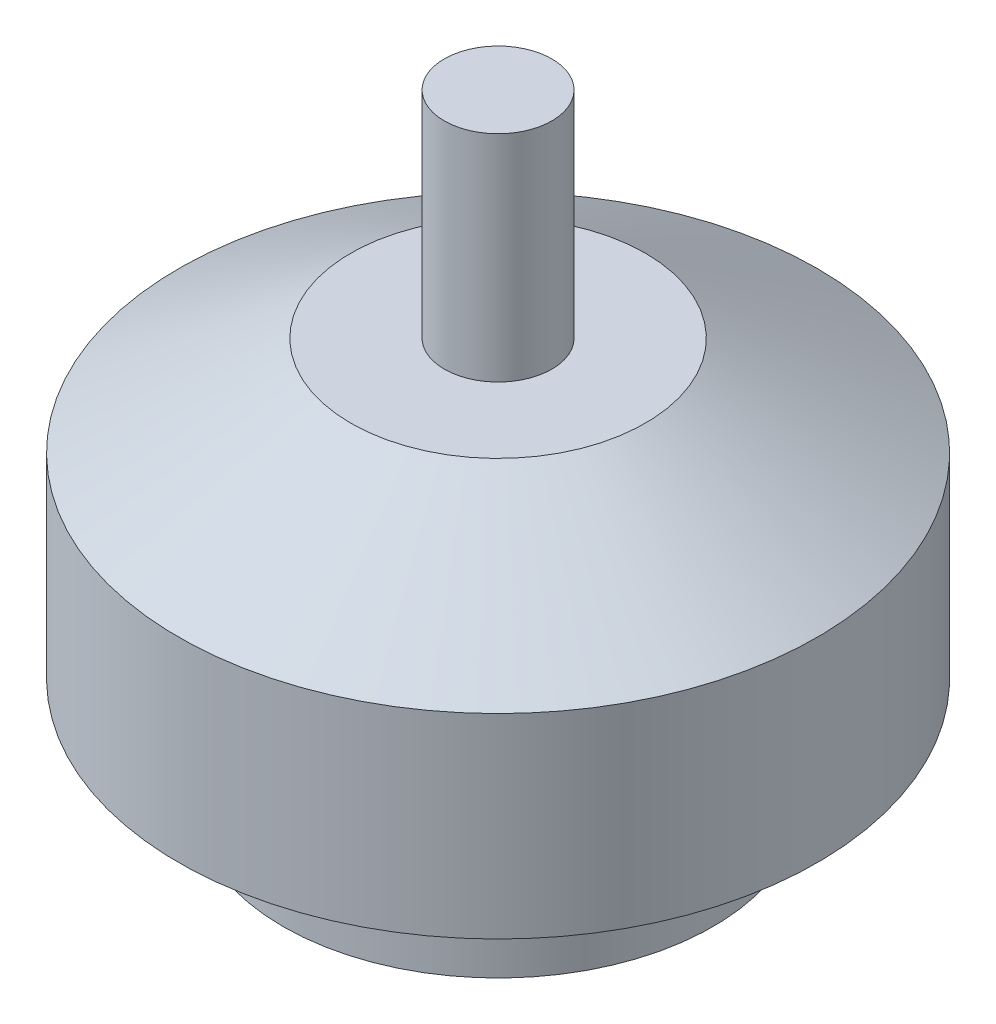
ISO-10303-21;
HEADER;
FILE_DESCRIPTION(('STEP AP214'),'2;1');
FILE_NAME('part.step','',(''),(''),'','','');
FILE_SCHEMA(('AUTOMOTIVE_DESIGN { 1 0 10303 214 1 1 1 1 }'));
ENDSEC;
DATA;
#1=APPLICATION_CONTEXT('core data for automotive mechanical design processes');
#2=APPLICATION_PROTOCOL_DEFINITION('international standard','automotive_design',2000,#1);
#3=PRODUCT_CONTEXT('',#1,'mechanical');
#4=PRODUCT('Part','Part','',(#3));
#5=PRODUCT_RELATED_PRODUCT_CATEGORY('part','',(#4));
#6=PRODUCT_DEFINITION_FORMATION('','',#4);
#7=PRODUCT_DEFINITION_CONTEXT('part definition',#1,'design');
#8=PRODUCT_DEFINITION('design','',#6,#7);
#9=PRODUCT_DEFINITION_SHAPE('','',#8);
#10=(LENGTH_UNIT() NAMED_UNIT(*) SI_UNIT(.MILLI.,.METRE.));
#11=(NAMED_UNIT(*) PLANE_ANGLE_UNIT() SI_UNIT($,.RADIAN.));
#12=(NAMED_UNIT(*) SI_UNIT($,.STERADIAN.) SOLID_ANGLE_UNIT());
#13=UNCERTAINTY_MEASURE_WITH_UNIT(LENGTH_MEASURE(1.E-05),#10,'distance_accuracy_value','');
#14=(GEOMETRIC_REPRESENTATION_CONTEXT(3) GLOBAL_UNCERTAINTY_ASSIGNED_CONTEXT((#13)) GLOBAL_UNIT_ASSIGNED_CONTEXT((#10,
#11,#12)) REPRESENTATION_CONTEXT('',''));
#15=CARTESIAN_POINT('',(0.,0.,0.));
#16=DIRECTION('',(0.,0.,1.));
#17=DIRECTION('',(1.,0.,0.));
#18=AXIS2_PLACEMENT_3D('',#15,#16,#17);
#19=CARTESIAN_POINT('',(0.,5.,0.));
#20=DIRECTION('',(0.,-1.,0.));
#21=DIRECTION('',(0.,0.,-1.));
#22=AXIS2_PLACEMENT_3D('',#19,#20,#21);
#23=CYLINDRICAL_SURFACE('',#22,10.);
#24=CARTESIAN_POINT('',(0.,5.,0.));
#25=DIRECTION('',(0.,1.,0.));
#26=DIRECTION('',(0.,0.,1.));
#27=AXIS2_PLACEMENT_3D('',#24,#25,#26);
#28=CIRCLE('',#27,10.);
#29=CARTESIAN_POINT('',(0.,5.,10.));
#30=VERTEX_POINT('',#29);
#31=EDGE_CURVE('E54',#30,#30,#28,.T.);
#32=ORIENTED_EDGE('',*,*,#31,.F.);
#33=EDGE_LOOP('',(#32));
#34=FACE_BOUND('',#33,.T.);
#35=CARTESIAN_POINT('',(0.,0.,0.));
#36=DIRECTION('',(0.,1.,0.));
#37=DIRECTION('',(0.,0.,1.));
#38=AXIS2_PLACEMENT_3D('',#35,#36,#37);
#39=CIRCLE('',#38,10.);
#40=CARTESIAN_POINT('',(0.,0.,10.));
#41=VERTEX_POINT('',#40);
#42=EDGE_CURVE('E53',#41,#41,#39,.T.);
#43=ORIENTED_EDGE('',*,*,#42,.T.);
#44=EDGE_LOOP('',(#43));
#45=FACE_BOUND('',#44,.T.);
#46=ADVANCED_FACE('F34',(#34,#45),#23,.T.);
#47=CARTESIAN_POINT('',(0.,0.,0.));
#48=DIRECTION('',(0.,1.,0.));
#49=DIRECTION('',(0.,0.,1.));
#50=AXIS2_PLACEMENT_3D('',#47,#48,#49);
#51=PLANE('',#50);
#52=ORIENTED_EDGE('',*,*,#42,.F.);
#53=EDGE_LOOP('',(#52));
#54=FACE_BOUND('',#53,.T.);
#55=ADVANCED_FACE('F78',(#54),#51,.F.);
#56=CARTESIAN_POINT('',(0.,18.7,0.));
#57=DIRECTION('',(0.,-1.,0.));
#58=DIRECTION('',(0.,0.,-1.));
#59=AXIS2_PLACEMENT_3D('',#56,#57,#58);
#60=CYLINDRICAL_SURFACE('',#59,14.85);
#61=CARTESIAN_POINT('',(0.,14.081197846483,0.));
#62=DIRECTION('',(0.,1.,0.));
#63=DIRECTION('',(0.,0.,1.));
#64=AXIS2_PLACEMENT_3D('',#61,#62,#63);
#65=CIRCLE('',#64,14.85);
#66=CARTESIAN_POINT('',(0.,14.081197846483,-14.85));
#67=VERTEX_POINT('',#66);
#68=EDGE_CURVE('E38',#67,#67,#65,.F.);
#69=CARTESIAN_POINT('',(0.,5.,0.));
#70=DIRECTION('',(0.,1.,0.));
#71=DIRECTION('',(0.,0.,1.));
#72=AXIS2_PLACEMENT_3D('',#69,#70,#71);
#73=CIRCLE('',#72,14.85);
#74=CARTESIAN_POINT('',(0.,5.,-14.85));
#75=VERTEX_POINT('',#74);
#76=EDGE_CURVE('E50',#75,#75,#73,.T.);
#77=CARTESIAN_POINT('',(0.,14.081197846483,-14.85));
#78=CARTESIAN_POINT('',(0.,13.9866020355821,-14.85));
#79=CARTESIAN_POINT('',(0.,13.8920062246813,-14.85));
#80=CARTESIAN_POINT('',(0.,13.7028146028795,-14.85));
#81=CARTESIAN_POINT('',(0.,13.6082187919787,-14.85));
#82=CARTESIAN_POINT('',(0.,13.4190271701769,-14.85));
#83=CARTESIAN_POINT('',(0.,13.3244313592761,-14.85));
#84=CARTESIAN_POINT('',(0.,13.1352397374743,-14.85));
#85=CARTESIAN_POINT('',(0.,13.0406439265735,-14.85));
#86=CARTESIAN_POINT('',(0.,12.8514523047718,-14.85));
#87=CARTESIAN_POINT('',(0.,12.7568564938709,-14.85));
#88=CARTESIAN_POINT('',(0.,12.5676648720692,-14.85));
#89=CARTESIAN_POINT('',(0.,12.4730690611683,-14.85));
#90=CARTESIAN_POINT('',(0.,12.2838774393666,-14.85));
#91=CARTESIAN_POINT('',(0.,12.1892816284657,-14.85));
#92=CARTESIAN_POINT('',(0.,12.000090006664,-14.85));
#93=CARTESIAN_POINT('',(0.,11.9054941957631,-14.85));
#94=CARTESIAN_POINT('',(0.,11.7163025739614,-14.85));
#95=CARTESIAN_POINT('',(0.,11.6217067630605,-14.85));
#96=CARTESIAN_POINT('',(0.,11.4325151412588,-14.85));
#97=CARTESIAN_POINT('',(0.,11.3379193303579,-14.85));
#98=CARTESIAN_POINT('',(0.,11.1487277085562,-14.85));
#99=CARTESIAN_POINT('',(0.,11.0541318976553,-14.85));
#100=CARTESIAN_POINT('',(0.,10.8649402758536,-14.85));
#101=CARTESIAN_POINT('',(0.,10.7703444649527,-14.85));
#102=CARTESIAN_POINT('',(0.,10.581152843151,-14.85));
#103=CARTESIAN_POINT('',(0.,10.4865570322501,-14.85));
#104=CARTESIAN_POINT('',(0.,10.2973654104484,-14.85));
#105=CARTESIAN_POINT('',(0.,10.2027695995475,-14.85));
#106=CARTESIAN_POINT('',(0.,10.0135779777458,-14.85));
#107=CARTESIAN_POINT('',(0.,9.91898216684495,-14.85));
#108=CARTESIAN_POINT('',(0.,9.72979054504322,-14.85));
#109=CARTESIAN_POINT('',(0.,9.63519473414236,-14.85));
#110=CARTESIAN_POINT('',(0.,9.44600311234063,-14.85));
#111=CARTESIAN_POINT('',(0.,9.35140730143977,-14.85));
#112=CARTESIAN_POINT('',(0.,9.16221567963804,-14.85));
#113=CARTESIAN_POINT('',(0.,9.06761986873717,-14.85));
#114=CARTESIAN_POINT('',(0.,8.87842824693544,-14.85));
#115=CARTESIAN_POINT('',(0.,8.78383243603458,-14.85));
#116=CARTESIAN_POINT('',(0.,8.59464081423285,-14.85));
#117=CARTESIAN_POINT('',(0.,8.50004500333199,-14.85));
#118=CARTESIAN_POINT('',(0.,8.31085338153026,-14.85));
#119=CARTESIAN_POINT('',(0.,8.21625757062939,-14.85));
#120=CARTESIAN_POINT('',(0.,8.02706594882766,-14.85));
#121=CARTESIAN_POINT('',(0.,7.9324701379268,-14.85));
#122=CARTESIAN_POINT('',(0.,7.74327851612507,-14.85));
#123=CARTESIAN_POINT('',(0.,7.64868270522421,-14.85));
#124=CARTESIAN_POINT('',(0.,7.45949108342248,-14.85));
#125=CARTESIAN_POINT('',(0.,7.36489527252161,-14.85));
#126=CARTESIAN_POINT('',(0.,7.17570365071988,-14.85));
#127=CARTESIAN_POINT('',(0.,7.08110783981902,-14.85));
#128=CARTESIAN_POINT('',(0.,6.89191621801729,-14.85));
#129=CARTESIAN_POINT('',(0.,6.79732040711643,-14.85));
#130=CARTESIAN_POINT('',(0.,6.6081287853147,-14.85));
#131=CARTESIAN_POINT('',(0.,6.51353297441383,-14.85));
#132=CARTESIAN_POINT('',(0.,6.3243413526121,-14.85));
#133=CARTESIAN_POINT('',(0.,6.22974554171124,-14.85));
#134=CARTESIAN_POINT('',(0.,6.04055391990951,-14.85));
#135=CARTESIAN_POINT('',(0.,5.94595810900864,-14.85));
#136=CARTESIAN_POINT('',(0.,5.75676648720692,-14.85));
#137=CARTESIAN_POINT('',(0.,5.66217067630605,-14.85));
#138=CARTESIAN_POINT('',(0.,5.47297905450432,-14.85));
#139=CARTESIAN_POINT('',(0.,5.37838324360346,-14.85));
#140=CARTESIAN_POINT('',(0.,5.18919162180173,-14.85));
#141=CARTESIAN_POINT('',(0.,5.09459581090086,-14.85));
#142=CARTESIAN_POINT('',(0.,5.,-14.85));
#143=B_SPLINE_CURVE_WITH_KNOTS('',3,(#77,#78,#79,#80,#81,#82,#83,#84,#85,#86,#87,#88,#89,#90,
#91,#92,#93,#94,#95,#96,#97,#98,#99,#100,#101,#102,#103,#104,#105,#106,#107,#108,#109,#110,#111,
#112,#113,#114,#115,#116,#117,#118,#119,#120,#121,#122,#123,#124,#125,#126,#127,#128,#129,#130,
#131,#132,#133,#134,#135,#136,#137,#138,#139,#140,#141,#142),.UNSPECIFIED.,.F.,.F.,(4,2,2,2,2,2,
2,2,2,2,2,2,2,2,2,2,2,2,2,2,2,2,2,2,2,2,2,2,2,2,2,2,4),(0.,0.283787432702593,0.567574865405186,
0.851362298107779,1.13514973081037,1.41893716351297,1.70272459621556,1.98651202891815,
2.27029946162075,2.55408689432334,2.83787432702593,3.12166175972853,3.40544919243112,
3.68923662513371,3.97302405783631,4.2568114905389,4.54059892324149,4.82438635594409,
5.10817378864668,5.39196122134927,5.67574865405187,5.95953608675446,6.24332351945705,
6.52711095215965,6.81089838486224,7.09468581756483,7.37847325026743,7.66226068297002,
7.94604811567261,8.22983554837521,8.5136229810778,8.7974104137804,9.08119784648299),.UNSPECIFIED.);
#144=EDGE_CURVE('BSEAM83',#67,#75,#143,.T.);
#145=ORIENTED_EDGE('',*,*,#68,.T.);
#146=ORIENTED_EDGE('',*,*,#76,.T.);
#147=ORIENTED_EDGE('',*,*,#144,.T.);
#148=ORIENTED_EDGE('',*,*,#144,.F.);
#149=EDGE_LOOP('',(#145,#147,#146,#148));
#150=FACE_BOUND('',#149,.T.);
#151=ADVANCED_FACE('F83',(#150),#60,.T.);
#152=CARTESIAN_POINT('',(0.,18.7,0.));
#153=DIRECTION('',(0.,1.,0.));
#154=DIRECTION('',(0.,0.,1.));
#155=AXIS2_PLACEMENT_3D('',#152,#153,#154);
#156=PLANE('',#155);
#157=CARTESIAN_POINT('',(0.,18.7,0.));
#158=DIRECTION('',(0.,1.,0.));
#159=DIRECTION('',(0.,0.,1.));
#160=AXIS2_PLACEMENT_3D('',#157,#158,#159);
#161=CIRCLE('',#160,2.5);
#162=CARTESIAN_POINT('',(0.,18.7,2.5));
#163=VERTEX_POINT('',#162);
#164=EDGE_CURVE('E10',#163,#163,#161,.T.);
#165=ORIENTED_EDGE('',*,*,#164,.F.);
#166=EDGE_LOOP('',(#165));
#167=FACE_BOUND('',#166,.T.);
#168=CARTESIAN_POINT('',(0.,18.7,0.));
#169=DIRECTION('',(0.,1.,0.));
#170=DIRECTION('',(0.,0.,1.));
#171=AXIS2_PLACEMENT_3D('',#168,#169,#170);
#172=CIRCLE('',#171,6.84999999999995);
#173=CARTESIAN_POINT('',(0.,18.7,6.84999999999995));
#174=VERTEX_POINT('',#173);
#175=EDGE_CURVE('E46',#174,#174,#172,.T.);
#176=ORIENTED_EDGE('',*,*,#175,.T.);
#177=EDGE_LOOP('',(#176));
#178=FACE_BOUND('',#177,.T.);
#179=ADVANCED_FACE('F61',(#167,#178),#156,.T.);
#180=CARTESIAN_POINT('',(0.,5.,0.));
#181=DIRECTION('',(0.,1.,0.));
#182=DIRECTION('',(0.,0.,1.));
#183=AXIS2_PLACEMENT_3D('',#180,#181,#182);
#184=PLANE('',#183);
#185=ORIENTED_EDGE('',*,*,#31,.T.);
#186=EDGE_LOOP('',(#185));
#187=FACE_BOUND('',#186,.T.);
#188=ORIENTED_EDGE('',*,*,#76,.F.);
#189=EDGE_LOOP('',(#188));
#190=FACE_BOUND('',#189,.T.);
#191=ADVANCED_FACE('F65',(#187,#190),#184,.F.);
#192=CARTESIAN_POINT('',(0.,18.7,0.));
#193=DIRECTION('',(0.,-1.,0.));
#194=DIRECTION('',(0.,0.,-1.));
#195=AXIS2_PLACEMENT_3D('',#192,#193,#194);
#196=CONICAL_SURFACE('',#195,6.84999999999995,1.0471975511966);
#197=ORIENTED_EDGE('',*,*,#68,.F.);
#198=EDGE_LOOP('',(#197));
#199=FACE_BOUND('',#198,.T.);
#200=ORIENTED_EDGE('',*,*,#175,.F.);
#201=EDGE_LOOP('',(#200));
#202=FACE_BOUND('',#201,.T.);
#203=ADVANCED_FACE('F36',(#199,#202),#196,.T.);
#204=CARTESIAN_POINT('',(0.,28.7,0.));
#205=DIRECTION('',(0.,-1.,0.));
#206=DIRECTION('',(0.,0.,-1.));
#207=AXIS2_PLACEMENT_3D('',#204,#205,#206);
#208=CYLINDRICAL_SURFACE('',#207,2.5);
#209=CARTESIAN_POINT('',(0.,28.7,0.));
#210=DIRECTION('',(0.,1.,0.));
#211=DIRECTION('',(0.,0.,1.));
#212=AXIS2_PLACEMENT_3D('',#209,#210,#211);
#213=CIRCLE('',#212,2.5);
#214=CARTESIAN_POINT('',(0.,28.7,2.5));
#215=VERTEX_POINT('',#214);
#216=EDGE_CURVE('E49',#215,#215,#213,.T.);
#217=ORIENTED_EDGE('',*,*,#216,.F.);
#218=EDGE_LOOP('',(#217));
#219=FACE_BOUND('',#218,.T.);
#220=ORIENTED_EDGE('',*,*,#164,.T.);
#221=EDGE_LOOP('',(#220));
#222=FACE_BOUND('',#221,.T.);
#223=ADVANCED_FACE('F64',(#219,#222),#208,.T.);
#224=CARTESIAN_POINT('',(0.,28.7,0.));
#225=DIRECTION('',(0.,1.,0.));
#226=DIRECTION('',(0.,0.,1.));
#227=AXIS2_PLACEMENT_3D('',#224,#225,#226);
#228=PLANE('',#227);
#229=ORIENTED_EDGE('',*,*,#216,.T.);
#230=EDGE_LOOP('',(#229));
#231=FACE_BOUND('',#230,.T.);
#232=ADVANCED_FACE('F71',(#231),#228,.T.);
#233=CLOSED_SHELL('',(#46,#55,#151,#179,#191,#203,#223,#232));
#234=MANIFOLD_SOLID_BREP('B2',#233);
#235=ADVANCED_BREP_SHAPE_REPRESENTATION('',(#18,#234),#14);
#236=SHAPE_DEFINITION_REPRESENTATION(#9,#235);
ENDSEC;
END-ISO-10303-21;
